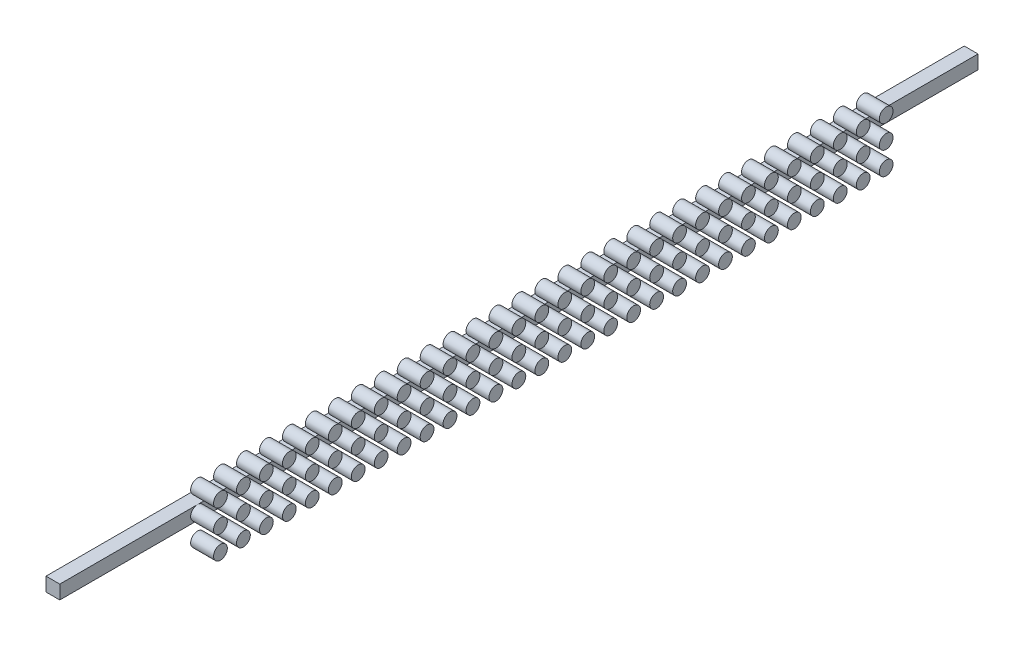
from build123d import *

# Parameters (mm, degrees)
SKETCH1_W           = 300
SKETCH1_H           = 300
BOSS_EXTRUDE1_DEPTH = 20000
SKETCH2_R           = 150
BOSS_EXTRUDE2_DEPTH = 500


with BuildPart() as part:
    # Sketch1 → Boss-Extrude1 (new body)
    with BuildSketch(Plane(origin=(0, 0, 0), x_dir=(0, 1, 0), z_dir=(0, 0, 1))):
        Rectangle(SKETCH1_W, SKETCH1_H)
    extrude(amount=BOSS_EXTRUDE1_DEPTH)

    # Sketch2 → Boss-Extrude2 (add)
    with BuildSketch(Plane.YZ.offset(150)):
        with Locations(Location((-500, 2500, 0), (0, 0, 270))):
            Circle(SKETCH2_R)
        with Locations(Location((0, 2500, 0), (0, 0, 180))):
            Circle(SKETCH2_R)
        with Locations(Location((500, 2500, 0), (0, 0, 270))):
            Circle(SKETCH2_R)
        with Locations(Location((-500, 3000, 0), (0, 0, 270))):
            Circle(SKETCH2_R)
        with Locations(Location((0, 3000, 0), (0, 0, 180))):
            Circle(SKETCH2_R)
        with Locations(Location((500, 3000, 0), (0, 0, 270))):
            Circle(SKETCH2_R)
        with Locations(Location((-500, 3500, 0), (0, 0, 270))):
            Circle(SKETCH2_R)
        with Locations(Location((0, 3500, 0), (0, 0, 180))):
            Circle(SKETCH2_R)
        with Locations(Location((500, 3500, 0), (0, 0, 270))):
            Circle(SKETCH2_R)
        with Locations(Location((-500, 4000, 0), (0, 0, 270))):
            Circle(SKETCH2_R)
        with Locations(Location((0, 4000, 0), (0, 0, 180))):
            Circle(SKETCH2_R)
        with Locations(Location((500, 4000, 0), (0, 0, 270))):
            Circle(SKETCH2_R)
        with Locations(Location((-500, 4500, 0), (0, 0, 270))):
            Circle(SKETCH2_R)
        with Locations(Location((0, 4500, 0), (0, 0, 180))):
            Circle(SKETCH2_R)
        with Locations(Location((500, 4500, 0), (0, 0, 270))):
            Circle(SKETCH2_R)
        with Locations(Location((-500, 5000, 0), (0, 0, 270))):
            Circle(SKETCH2_R)
        with Locations(Location((0, 5000, 0), (0, 0, 180))):
            Circle(SKETCH2_R)
        with Locations(Location((500, 5000, 0), (0, 0, 270))):
            Circle(SKETCH2_R)
        with Locations(Location((-500, 5500, 0), (0, 0, 270))):
            Circle(SKETCH2_R)
        with Locations(Location((0, 5500, 0), (0, 0, 180))):
            Circle(SKETCH2_R)
        with Locations(Location((500, 5500, 0), (0, 0, 270))):
            Circle(SKETCH2_R)
        with Locations(Location((-500, 6000, 0), (0, 0, 270))):
            Circle(SKETCH2_R)
        with Locations(Location((0, 6000, 0), (0, 0, 180))):
            Circle(SKETCH2_R)
        with Locations(Location((500, 6000, 0), (0, 0, 270))):
            Circle(SKETCH2_R)
        with Locations(Location((-500, 6500, 0), (0, 0, 270))):
            Circle(SKETCH2_R)
        with Locations(Location((0, 6500, 0), (0, 0, 180))):
            Circle(SKETCH2_R)
        with Locations(Location((500, 6500, 0), (0, 0, 270))):
            Circle(SKETCH2_R)
        with Locations(Location((-500, 7000, 0), (0, 0, 270))):
            Circle(SKETCH2_R)
        with Locations(Location((0, 7000, 0), (0, 0, 180))):
            Circle(SKETCH2_R)
        with Locations(Location((500, 7000, 0), (0, 0, 270))):
            Circle(SKETCH2_R)
        with Locations(Location((-500, 7500, 0), (0, 0, 270))):
            Circle(SKETCH2_R)
        with Locations(Location((0, 7500, 0), (0, 0, 180))):
            Circle(SKETCH2_R)
        with Locations(Location((500, 7500, 0), (0, 0, 270))):
            Circle(SKETCH2_R)
        with Locations(Location((-500, 8000, 0), (0, 0, 270))):
            Circle(SKETCH2_R)
        with Locations(Location((0, 8000, 0), (0, 0, 180))):
            Circle(SKETCH2_R)
        with Locations(Location((500, 8000, 0), (0, 0, 270))):
            Circle(SKETCH2_R)
        with Locations(Location((-500, 8500, 0), (0, 0, 270))):
            Circle(SKETCH2_R)
        with Locations(Location((0, 8500, 0), (0, 0, 180))):
            Circle(SKETCH2_R)
        with Locations(Location((500, 8500, 0), (0, 0, 270))):
            Circle(SKETCH2_R)
        with Locations(Location((-500, 9000, 0), (0, 0, 270))):
            Circle(SKETCH2_R)
        with Locations(Location((0, 9000, 0), (0, 0, 180))):
            Circle(SKETCH2_R)
        with Locations(Location((500, 9000, 0), (0, 0, 270))):
            Circle(SKETCH2_R)
        with Locations(Location((-500, 9500, 0), (0, 0, 270))):
            Circle(SKETCH2_R)
        with Locations(Location((0, 9500, 0), (0, 0, 180))):
            Circle(SKETCH2_R)
        with Locations(Location((500, 9500, 0), (0, 0, 270))):
            Circle(SKETCH2_R)
        with Locations(Location((-500, 10000, 0), (0, 0, 270))):
            Circle(SKETCH2_R)
        with Locations(Location((0, 10000, 0), (0, 0, 180))):
            Circle(SKETCH2_R)
        with Locations(Location((500, 10000, 0), (0, 0, 270))):
            Circle(SKETCH2_R)
        with Locations(Location((-500, 10500, 0), (0, 0, 270))):
            Circle(SKETCH2_R)
        with Locations(Location((0, 10500, 0), (0, 0, 180))):
            Circle(SKETCH2_R)
        with Locations(Location((500, 10500, 0), (0, 0, 270))):
            Circle(SKETCH2_R)
        with Locations(Location((-500, 11000, 0), (0, 0, 270))):
            Circle(SKETCH2_R)
        with Locations(Location((0, 11000, 0), (0, 0, 180))):
            Circle(SKETCH2_R)
        with Locations(Location((500, 11000, 0), (0, 0, 270))):
            Circle(SKETCH2_R)
        with Locations(Location((-500, 11500, 0), (0, 0, 270))):
            Circle(SKETCH2_R)
        with Locations(Location((0, 11500, 0), (0, 0, 180))):
            Circle(SKETCH2_R)
        with Locations(Location((500, 11500, 0), (0, 0, 270))):
            Circle(SKETCH2_R)
        with Locations(Location((-500, 12000, 0), (0, 0, 270))):
            Circle(SKETCH2_R)
        with Locations(Location((0, 12000, 0), (0, 0, 180))):
            Circle(SKETCH2_R)
        with Locations(Location((500, 12000, 0), (0, 0, 270))):
            Circle(SKETCH2_R)
        with Locations(Location((-500, 12500, 0), (0, 0, 270))):
            Circle(SKETCH2_R)
        with Locations(Location((0, 12500, 0), (0, 0, 180))):
            Circle(SKETCH2_R)
        with Locations(Location((500, 12500, 0), (0, 0, 270))):
            Circle(SKETCH2_R)
        with Locations(Location((-500, 13000, 0), (0, 0, 270))):
            Circle(SKETCH2_R)
        with Locations(Location((0, 13000, 0), (0, 0, 180))):
            Circle(SKETCH2_R)
        with Locations(Location((500, 13000, 0), (0, 0, 270))):
            Circle(SKETCH2_R)
        with Locations(Location((-500, 13500, 0), (0, 0, 270))):
            Circle(SKETCH2_R)
        with Locations(Location((0, 13500, 0), (0, 0, 180))):
            Circle(SKETCH2_R)
        with Locations(Location((500, 13500, 0), (0, 0, 270))):
            Circle(SKETCH2_R)
        with Locations(Location((-500, 14000, 0), (0, 0, 270))):
            Circle(SKETCH2_R)
        with Locations(Location((0, 14000, 0), (0, 0, 180))):
            Circle(SKETCH2_R)
        with Locations(Location((500, 14000, 0), (0, 0, 270))):
            Circle(SKETCH2_R)
        with Locations(Location((-500, 14500, 0), (0, 0, 270))):
            Circle(SKETCH2_R)
        with Locations(Location((0, 14500, 0), (0, 0, 180))):
            Circle(SKETCH2_R)
        with Locations(Location((500, 14500, 0), (0, 0, 270))):
            Circle(SKETCH2_R)
        with Locations(Location((-500, 15000, 0), (0, 0, 270))):
            Circle(SKETCH2_R)
        with Locations(Location((0, 15000, 0), (0, 0, 180))):
            Circle(SKETCH2_R)
        with Locations(Location((500, 15000, 0), (0, 0, 270))):
            Circle(SKETCH2_R)
        with Locations(Location((-500, 15500, 0), (0, 0, 270))):
            Circle(SKETCH2_R)
        with Locations(Location((0, 15500, 0), (0, 0, 180))):
            Circle(SKETCH2_R)
        with Locations(Location((500, 15500, 0), (0, 0, 270))):
            Circle(SKETCH2_R)
        with Locations(Location((-500, 16000, 0), (0, 0, 270))):
            Circle(SKETCH2_R)
        with Locations(Location((0, 16000, 0), (0, 0, 180))):
            Circle(SKETCH2_R)
        with Locations(Location((500, 16000, 0), (0, 0, 270))):
            Circle(SKETCH2_R)
        with Locations(Location((-500, 16500, 0), (0, 0, 270))):
            Circle(SKETCH2_R)
        with Locations(Location((0, 16500, 0), (0, 0, 180))):
            Circle(SKETCH2_R)
        with Locations(Location((500, 16500, 0), (0, 0, 270))):
            Circle(SKETCH2_R)
        with Locations(Location((-500, 17000, 0), (0, 0, 270))):
            Circle(SKETCH2_R)
        with Locations(Location((0, 17000, 0), (0, 0, 180))):
            Circle(SKETCH2_R)
        with Locations(Location((500, 17000, 0), (0, 0, 270))):
            Circle(SKETCH2_R)
    extrude(amount=BOSS_EXTRUDE2_DEPTH)


solid = part.part
